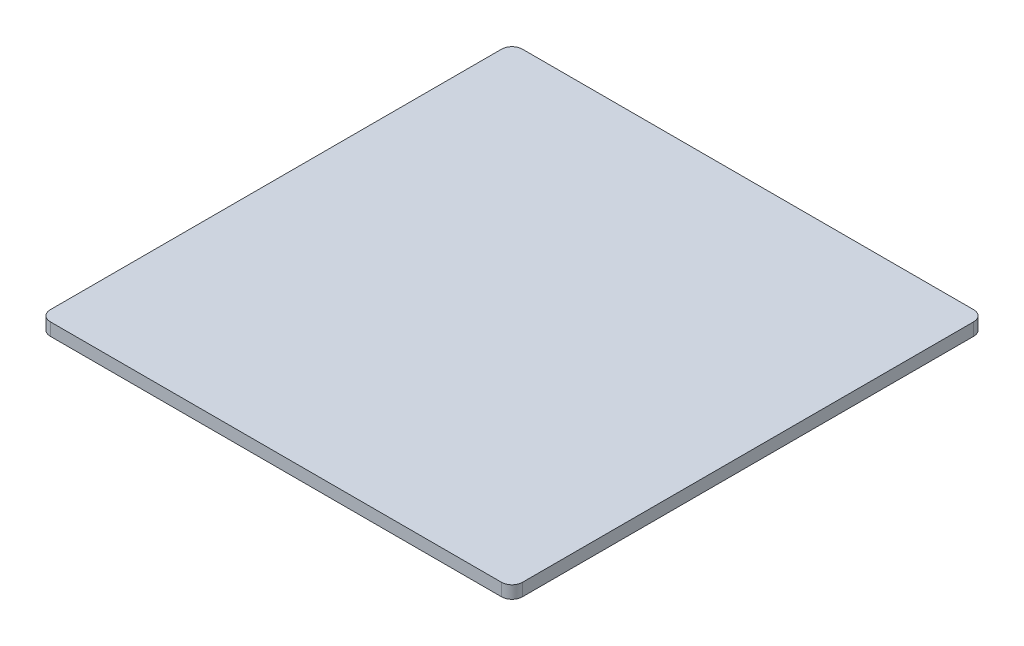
ISO-10303-21;
HEADER;
FILE_DESCRIPTION(('STEP AP214'),'2;1');
FILE_NAME('part.step','',(''),(''),'','','');
FILE_SCHEMA(('AUTOMOTIVE_DESIGN { 1 0 10303 214 1 1 1 1 }'));
ENDSEC;
DATA;
#1=APPLICATION_CONTEXT('core data for automotive mechanical design processes');
#2=APPLICATION_PROTOCOL_DEFINITION('international standard','automotive_design',2000,#1);
#3=PRODUCT_CONTEXT('',#1,'mechanical');
#4=PRODUCT('Part','Part','',(#3));
#5=PRODUCT_RELATED_PRODUCT_CATEGORY('part','',(#4));
#6=PRODUCT_DEFINITION_FORMATION('','',#4);
#7=PRODUCT_DEFINITION_CONTEXT('part definition',#1,'design');
#8=PRODUCT_DEFINITION('design','',#6,#7);
#9=PRODUCT_DEFINITION_SHAPE('','',#8);
#10=(LENGTH_UNIT() NAMED_UNIT(*) SI_UNIT(.MILLI.,.METRE.));
#11=(NAMED_UNIT(*) PLANE_ANGLE_UNIT() SI_UNIT($,.RADIAN.));
#12=(NAMED_UNIT(*) SI_UNIT($,.STERADIAN.) SOLID_ANGLE_UNIT());
#13=UNCERTAINTY_MEASURE_WITH_UNIT(LENGTH_MEASURE(1.E-05),#10,'distance_accuracy_value','');
#14=(GEOMETRIC_REPRESENTATION_CONTEXT(3) GLOBAL_UNCERTAINTY_ASSIGNED_CONTEXT((#13)) GLOBAL_UNIT_ASSIGNED_CONTEXT((#10,
#11,#12)) REPRESENTATION_CONTEXT('',''));
#15=CARTESIAN_POINT('',(0.,0.,0.));
#16=DIRECTION('',(0.,0.,1.));
#17=DIRECTION('',(1.,0.,0.));
#18=AXIS2_PLACEMENT_3D('',#15,#16,#17);
#19=CARTESIAN_POINT('',(225.,-12.,-225.));
#20=DIRECTION('',(1.,0.,0.));
#21=DIRECTION('',(0.,0.,-1.));
#22=AXIS2_PLACEMENT_3D('',#19,#20,#21);
#23=PLANE('',#22);
#24=DIRECTION('',(0.,0.,-1.));
#25=VECTOR('',#24,1.);
#26=CARTESIAN_POINT('',(225.,-12.,-225.));
#27=LINE('',#26,#25);
#28=CARTESIAN_POINT('',(225.,-12.,215.));
#29=VERTEX_POINT('',#28);
#30=CARTESIAN_POINT('',(225.,-12.,-215.));
#31=VERTEX_POINT('',#30);
#32=EDGE_CURVE('E162',#29,#31,#27,.T.);
#33=ORIENTED_EDGE('',*,*,#32,.T.);
#34=DIRECTION('',(0.,1.,0.));
#35=VECTOR('',#34,1.);
#36=CARTESIAN_POINT('',(225.,-12.,-215.));
#37=LINE('',#36,#35);
#38=CARTESIAN_POINT('',(225.,0.,-215.));
#39=VERTEX_POINT('',#38);
#40=EDGE_CURVE('E117',#31,#39,#37,.T.);
#41=ORIENTED_EDGE('',*,*,#40,.T.);
#42=DIRECTION('',(0.,0.,-1.));
#43=VECTOR('',#42,1.);
#44=CARTESIAN_POINT('',(225.,0.,-225.));
#45=LINE('',#44,#43);
#46=CARTESIAN_POINT('',(225.,0.,215.));
#47=VERTEX_POINT('',#46);
#48=EDGE_CURVE('E101',#47,#39,#45,.T.);
#49=ORIENTED_EDGE('',*,*,#48,.F.);
#50=DIRECTION('',(0.,1.,0.));
#51=VECTOR('',#50,1.);
#52=CARTESIAN_POINT('',(225.,-12.,215.));
#53=LINE('',#52,#51);
#54=EDGE_CURVE('E114',#47,#29,#53,.F.);
#55=ORIENTED_EDGE('',*,*,#54,.T.);
#56=EDGE_LOOP('',(#33,#41,#49,#55));
#57=FACE_BOUND('',#56,.T.);
#58=ADVANCED_FACE('F32',(#57),#23,.T.);
#59=CARTESIAN_POINT('',(-225.,-12.,225.));
#60=DIRECTION('',(0.,0.,1.));
#61=DIRECTION('',(1.,0.,0.));
#62=AXIS2_PLACEMENT_3D('',#59,#60,#61);
#63=PLANE('',#62);
#64=DIRECTION('',(1.,0.,0.));
#65=VECTOR('',#64,1.);
#66=CARTESIAN_POINT('',(-225.,-12.,225.));
#67=LINE('',#66,#65);
#68=CARTESIAN_POINT('',(-215.,-12.,225.));
#69=VERTEX_POINT('',#68);
#70=CARTESIAN_POINT('',(215.,-12.,225.));
#71=VERTEX_POINT('',#70);
#72=EDGE_CURVE('E123',#69,#71,#67,.T.);
#73=ORIENTED_EDGE('',*,*,#72,.T.);
#74=DIRECTION('',(0.,1.,0.));
#75=VECTOR('',#74,1.);
#76=CARTESIAN_POINT('',(215.,-12.,225.));
#77=LINE('',#76,#75);
#78=CARTESIAN_POINT('',(215.,0.,225.));
#79=VERTEX_POINT('',#78);
#80=EDGE_CURVE('E149',#71,#79,#77,.T.);
#81=ORIENTED_EDGE('',*,*,#80,.T.);
#82=DIRECTION('',(1.,0.,0.));
#83=VECTOR('',#82,1.);
#84=CARTESIAN_POINT('',(-225.,0.,225.));
#85=LINE('',#84,#83);
#86=CARTESIAN_POINT('',(-215.,0.,225.));
#87=VERTEX_POINT('',#86);
#88=EDGE_CURVE('E103',#87,#79,#85,.T.);
#89=ORIENTED_EDGE('',*,*,#88,.F.);
#90=DIRECTION('',(0.,1.,0.));
#91=VECTOR('',#90,1.);
#92=CARTESIAN_POINT('',(-215.,-12.,225.));
#93=LINE('',#92,#91);
#94=EDGE_CURVE('E147',#87,#69,#93,.F.);
#95=ORIENTED_EDGE('',*,*,#94,.T.);
#96=EDGE_LOOP('',(#73,#81,#89,#95));
#97=FACE_BOUND('',#96,.T.);
#98=ADVANCED_FACE('F151',(#97),#63,.T.);
#99=CARTESIAN_POINT('',(-225.,-12.,-225.));
#100=DIRECTION('',(-1.,0.,0.));
#101=DIRECTION('',(0.,0.,1.));
#102=AXIS2_PLACEMENT_3D('',#99,#100,#101);
#103=PLANE('',#102);
#104=DIRECTION('',(0.,0.,1.));
#105=VECTOR('',#104,1.);
#106=CARTESIAN_POINT('',(-225.,-12.,-225.));
#107=LINE('',#106,#105);
#108=CARTESIAN_POINT('',(-225.,-12.,-215.));
#109=VERTEX_POINT('',#108);
#110=CARTESIAN_POINT('',(-225.,-12.,215.));
#111=VERTEX_POINT('',#110);
#112=EDGE_CURVE('E128',#109,#111,#107,.T.);
#113=ORIENTED_EDGE('',*,*,#112,.T.);
#114=DIRECTION('',(0.,1.,0.));
#115=VECTOR('',#114,1.);
#116=CARTESIAN_POINT('',(-225.,-12.,215.));
#117=LINE('',#116,#115);
#118=CARTESIAN_POINT('',(-225.,0.,215.));
#119=VERTEX_POINT('',#118);
#120=EDGE_CURVE('E11',#111,#119,#117,.T.);
#121=ORIENTED_EDGE('',*,*,#120,.T.);
#122=DIRECTION('',(0.,0.,1.));
#123=VECTOR('',#122,1.);
#124=CARTESIAN_POINT('',(-225.,0.,-225.));
#125=LINE('',#124,#123);
#126=CARTESIAN_POINT('',(-225.,0.,-215.));
#127=VERTEX_POINT('',#126);
#128=EDGE_CURVE('E160',#127,#119,#125,.T.);
#129=ORIENTED_EDGE('',*,*,#128,.F.);
#130=DIRECTION('',(0.,1.,0.));
#131=VECTOR('',#130,1.);
#132=CARTESIAN_POINT('',(-225.,-12.,-215.));
#133=LINE('',#132,#131);
#134=EDGE_CURVE('E40',#127,#109,#133,.F.);
#135=ORIENTED_EDGE('',*,*,#134,.T.);
#136=EDGE_LOOP('',(#113,#121,#129,#135));
#137=FACE_BOUND('',#136,.T.);
#138=ADVANCED_FACE('F159',(#137),#103,.T.);
#139=CARTESIAN_POINT('',(-225.,-12.,-225.));
#140=DIRECTION('',(0.,0.,-1.));
#141=DIRECTION('',(-1.,0.,0.));
#142=AXIS2_PLACEMENT_3D('',#139,#140,#141);
#143=PLANE('',#142);
#144=DIRECTION('',(-1.,0.,0.));
#145=VECTOR('',#144,1.);
#146=CARTESIAN_POINT('',(-225.,0.,-225.));
#147=LINE('',#146,#145);
#148=CARTESIAN_POINT('',(215.,0.,-225.));
#149=VERTEX_POINT('',#148);
#150=CARTESIAN_POINT('',(-215.,0.,-225.));
#151=VERTEX_POINT('',#150);
#152=EDGE_CURVE('E118',#149,#151,#147,.T.);
#153=ORIENTED_EDGE('',*,*,#152,.F.);
#154=DIRECTION('',(0.,1.,0.));
#155=VECTOR('',#154,1.);
#156=CARTESIAN_POINT('',(215.,-12.,-225.));
#157=LINE('',#156,#155);
#158=CARTESIAN_POINT('',(215.,-12.,-225.));
#159=VERTEX_POINT('',#158);
#160=EDGE_CURVE('E139',#149,#159,#157,.F.);
#161=ORIENTED_EDGE('',*,*,#160,.T.);
#162=DIRECTION('',(-1.,0.,0.));
#163=VECTOR('',#162,1.);
#164=CARTESIAN_POINT('',(-225.,-12.,-225.));
#165=LINE('',#164,#163);
#166=CARTESIAN_POINT('',(-215.,-12.,-225.));
#167=VERTEX_POINT('',#166);
#168=EDGE_CURVE('E166',#159,#167,#165,.T.);
#169=ORIENTED_EDGE('',*,*,#168,.T.);
#170=DIRECTION('',(0.,1.,0.));
#171=VECTOR('',#170,1.);
#172=CARTESIAN_POINT('',(-215.,-12.,-225.));
#173=LINE('',#172,#171);
#174=EDGE_CURVE('E136',#167,#151,#173,.T.);
#175=ORIENTED_EDGE('',*,*,#174,.T.);
#176=EDGE_LOOP('',(#153,#161,#169,#175));
#177=FACE_BOUND('',#176,.T.);
#178=ADVANCED_FACE('F175',(#177),#143,.T.);
#179=CARTESIAN_POINT('',(0.,-12.,0.));
#180=DIRECTION('',(0.,1.,0.));
#181=DIRECTION('',(0.,0.,1.));
#182=AXIS2_PLACEMENT_3D('',#179,#180,#181);
#183=PLANE('',#182);
#184=ORIENTED_EDGE('',*,*,#168,.F.);
#185=CARTESIAN_POINT('',(215.,-12.,-215.));
#186=DIRECTION('',(0.,1.,0.));
#187=DIRECTION('',(0.,0.,1.));
#188=AXIS2_PLACEMENT_3D('',#185,#186,#187);
#189=CIRCLE('',#188,10.);
#190=EDGE_CURVE('E145',#159,#31,#189,.F.);
#191=ORIENTED_EDGE('',*,*,#190,.T.);
#192=ORIENTED_EDGE('',*,*,#32,.F.);
#193=CARTESIAN_POINT('',(215.,-12.,215.));
#194=DIRECTION('',(0.,1.,0.));
#195=DIRECTION('',(0.,0.,1.));
#196=AXIS2_PLACEMENT_3D('',#193,#194,#195);
#197=CIRCLE('',#196,10.);
#198=EDGE_CURVE('E122',#29,#71,#197,.F.);
#199=ORIENTED_EDGE('',*,*,#198,.T.);
#200=ORIENTED_EDGE('',*,*,#72,.F.);
#201=CARTESIAN_POINT('',(-215.,-12.,215.));
#202=DIRECTION('',(0.,1.,0.));
#203=DIRECTION('',(0.,0.,1.));
#204=AXIS2_PLACEMENT_3D('',#201,#202,#203);
#205=CIRCLE('',#204,10.);
#206=EDGE_CURVE('E47',#69,#111,#205,.F.);
#207=ORIENTED_EDGE('',*,*,#206,.T.);
#208=ORIENTED_EDGE('',*,*,#112,.F.);
#209=CARTESIAN_POINT('',(-215.,-12.,-215.));
#210=DIRECTION('',(0.,1.,0.));
#211=DIRECTION('',(0.,0.,1.));
#212=AXIS2_PLACEMENT_3D('',#209,#210,#211);
#213=CIRCLE('',#212,10.);
#214=EDGE_CURVE('E141',#109,#167,#213,.F.);
#215=ORIENTED_EDGE('',*,*,#214,.T.);
#216=EDGE_LOOP('',(#184,#191,#192,#199,#200,#207,#208,#215));
#217=FACE_BOUND('',#216,.T.);
#218=ADVANCED_FACE('F154',(#217),#183,.F.);
#219=CARTESIAN_POINT('',(0.,0.,0.));
#220=DIRECTION('',(0.,1.,0.));
#221=DIRECTION('',(0.,0.,1.));
#222=AXIS2_PLACEMENT_3D('',#219,#220,#221);
#223=PLANE('',#222);
#224=ORIENTED_EDGE('',*,*,#48,.T.);
#225=CARTESIAN_POINT('',(215.,0.,-215.));
#226=DIRECTION('',(0.,1.,0.));
#227=DIRECTION('',(0.,0.,1.));
#228=AXIS2_PLACEMENT_3D('',#225,#226,#227);
#229=CIRCLE('',#228,10.);
#230=EDGE_CURVE('E108',#39,#149,#229,.T.);
#231=ORIENTED_EDGE('',*,*,#230,.T.);
#232=ORIENTED_EDGE('',*,*,#152,.T.);
#233=CARTESIAN_POINT('',(-215.,0.,-215.));
#234=DIRECTION('',(0.,1.,0.));
#235=DIRECTION('',(0.,0.,1.));
#236=AXIS2_PLACEMENT_3D('',#233,#234,#235);
#237=CIRCLE('',#236,10.);
#238=EDGE_CURVE('E125',#151,#127,#237,.T.);
#239=ORIENTED_EDGE('',*,*,#238,.T.);
#240=ORIENTED_EDGE('',*,*,#128,.T.);
#241=CARTESIAN_POINT('',(-215.,0.,215.));
#242=DIRECTION('',(0.,1.,0.));
#243=DIRECTION('',(0.,0.,1.));
#244=AXIS2_PLACEMENT_3D('',#241,#242,#243);
#245=CIRCLE('',#244,10.);
#246=EDGE_CURVE('E109',#119,#87,#245,.T.);
#247=ORIENTED_EDGE('',*,*,#246,.T.);
#248=ORIENTED_EDGE('',*,*,#88,.T.);
#249=CARTESIAN_POINT('',(215.,0.,215.));
#250=DIRECTION('',(0.,1.,0.));
#251=DIRECTION('',(0.,0.,1.));
#252=AXIS2_PLACEMENT_3D('',#249,#250,#251);
#253=CIRCLE('',#252,10.);
#254=EDGE_CURVE('E98',#79,#47,#253,.T.);
#255=ORIENTED_EDGE('',*,*,#254,.T.);
#256=EDGE_LOOP('',(#224,#231,#232,#239,#240,#247,#248,#255));
#257=FACE_BOUND('',#256,.T.);
#258=ADVANCED_FACE('F100',(#257),#223,.T.);
#259=CARTESIAN_POINT('',(215.,-12.,-215.));
#260=DIRECTION('',(0.,1.,0.));
#261=DIRECTION('',(0.,0.,1.));
#262=AXIS2_PLACEMENT_3D('',#259,#260,#261);
#263=CYLINDRICAL_SURFACE('',#262,10.);
#264=ORIENTED_EDGE('',*,*,#190,.F.);
#265=ORIENTED_EDGE('',*,*,#160,.F.);
#266=ORIENTED_EDGE('',*,*,#230,.F.);
#267=ORIENTED_EDGE('',*,*,#40,.F.);
#268=EDGE_LOOP('',(#264,#265,#266,#267));
#269=FACE_BOUND('',#268,.T.);
#270=ADVANCED_FACE('F171',(#269),#263,.T.);
#271=CARTESIAN_POINT('',(215.,-12.,215.));
#272=DIRECTION('',(0.,1.,0.));
#273=DIRECTION('',(0.,0.,1.));
#274=AXIS2_PLACEMENT_3D('',#271,#272,#273);
#275=CYLINDRICAL_SURFACE('',#274,10.);
#276=ORIENTED_EDGE('',*,*,#198,.F.);
#277=ORIENTED_EDGE('',*,*,#54,.F.);
#278=ORIENTED_EDGE('',*,*,#254,.F.);
#279=ORIENTED_EDGE('',*,*,#80,.F.);
#280=EDGE_LOOP('',(#276,#277,#278,#279));
#281=FACE_BOUND('',#280,.T.);
#282=ADVANCED_FACE('F121',(#281),#275,.T.);
#283=CARTESIAN_POINT('',(-215.,-12.,215.));
#284=DIRECTION('',(0.,1.,0.));
#285=DIRECTION('',(0.,0.,1.));
#286=AXIS2_PLACEMENT_3D('',#283,#284,#285);
#287=CYLINDRICAL_SURFACE('',#286,10.);
#288=ORIENTED_EDGE('',*,*,#206,.F.);
#289=ORIENTED_EDGE('',*,*,#94,.F.);
#290=ORIENTED_EDGE('',*,*,#246,.F.);
#291=ORIENTED_EDGE('',*,*,#120,.F.);
#292=EDGE_LOOP('',(#288,#289,#290,#291));
#293=FACE_BOUND('',#292,.T.);
#294=ADVANCED_FACE('F157',(#293),#287,.T.);
#295=CARTESIAN_POINT('',(-215.,-12.,-215.));
#296=DIRECTION('',(0.,1.,0.));
#297=DIRECTION('',(0.,0.,1.));
#298=AXIS2_PLACEMENT_3D('',#295,#296,#297);
#299=CYLINDRICAL_SURFACE('',#298,10.);
#300=ORIENTED_EDGE('',*,*,#214,.F.);
#301=ORIENTED_EDGE('',*,*,#134,.F.);
#302=ORIENTED_EDGE('',*,*,#238,.F.);
#303=ORIENTED_EDGE('',*,*,#174,.F.);
#304=EDGE_LOOP('',(#300,#301,#302,#303));
#305=FACE_BOUND('',#304,.T.);
#306=ADVANCED_FACE('F34',(#305),#299,.T.);
#307=CLOSED_SHELL('',(#58,#98,#138,#178,#218,#258,#270,#282,#294,#306));
#308=MANIFOLD_SOLID_BREP('B2',#307);
#309=ADVANCED_BREP_SHAPE_REPRESENTATION('',(#18,#308),#14);
#310=SHAPE_DEFINITION_REPRESENTATION(#9,#309);
ENDSEC;
END-ISO-10303-21;
